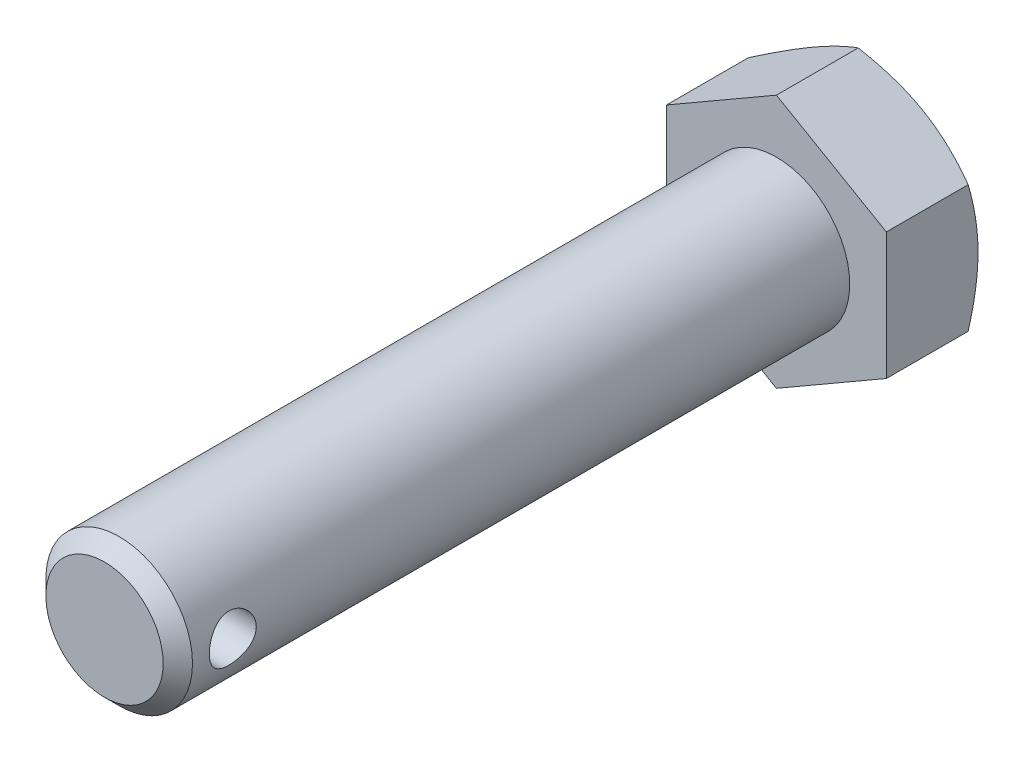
ISO-10303-21;
HEADER;
FILE_DESCRIPTION(('STEP AP214'),'2;1');
FILE_NAME('part.step','',(''),(''),'','','');
FILE_SCHEMA(('AUTOMOTIVE_DESIGN { 1 0 10303 214 1 1 1 1 }'));
ENDSEC;
DATA;
#1=APPLICATION_CONTEXT('core data for automotive mechanical design processes');
#2=APPLICATION_PROTOCOL_DEFINITION('international standard','automotive_design',2000,#1);
#3=PRODUCT_CONTEXT('',#1,'mechanical');
#4=PRODUCT('Part','Part','',(#3));
#5=PRODUCT_RELATED_PRODUCT_CATEGORY('part','',(#4));
#6=PRODUCT_DEFINITION_FORMATION('','',#4);
#7=PRODUCT_DEFINITION_CONTEXT('part definition',#1,'design');
#8=PRODUCT_DEFINITION('design','',#6,#7);
#9=PRODUCT_DEFINITION_SHAPE('','',#8);
#10=(LENGTH_UNIT() NAMED_UNIT(*) SI_UNIT(.MILLI.,.METRE.));
#11=(NAMED_UNIT(*) PLANE_ANGLE_UNIT() SI_UNIT($,.RADIAN.));
#12=(NAMED_UNIT(*) SI_UNIT($,.STERADIAN.) SOLID_ANGLE_UNIT());
#13=UNCERTAINTY_MEASURE_WITH_UNIT(LENGTH_MEASURE(1.E-05),#10,'distance_accuracy_value','');
#14=(GEOMETRIC_REPRESENTATION_CONTEXT(3) GLOBAL_UNCERTAINTY_ASSIGNED_CONTEXT((#13)) GLOBAL_UNIT_ASSIGNED_CONTEXT((#10,
#11,#12)) REPRESENTATION_CONTEXT('',''));
#15=CARTESIAN_POINT('',(0.,0.,0.));
#16=DIRECTION('',(0.,0.,1.));
#17=DIRECTION('',(1.,0.,0.));
#18=AXIS2_PLACEMENT_3D('',#15,#16,#17);
#19=CARTESIAN_POINT('',(-8.32667268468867E-13,-1.11022302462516E-13,55.));
#20=DIRECTION('',(0.,0.,1.));
#21=DIRECTION('',(1.00000000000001,0.,0.));
#22=AXIS2_PLACEMENT_3D('',#19,#20,#21);
#23=PLANE('',#22);
#24=CARTESIAN_POINT('',(-8.32667268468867E-13,-1.11022302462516E-13,55.));
#25=DIRECTION('',(0.,0.,1.));
#26=DIRECTION('',(1.00000000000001,0.,0.));
#27=AXIS2_PLACEMENT_3D('',#24,#25,#26);
#28=CIRCLE('',#27,4.80000000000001);
#29=CARTESIAN_POINT('',(4.79999999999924,-1.11288755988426E-13,55.));
#30=VERTEX_POINT('',#29);
#31=EDGE_CURVE('E209',#30,#30,#28,.T.);
#32=ORIENTED_EDGE('',*,*,#31,.T.);
#33=EDGE_LOOP('',(#32));
#34=FACE_BOUND('',#33,.T.);
#35=ADVANCED_FACE('F28',(#34),#23,.T.);
#36=CARTESIAN_POINT('',(0.,0.,0.));
#37=DIRECTION('',(0.,0.,1.));
#38=DIRECTION('',(1.00000000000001,0.,0.));
#39=AXIS2_PLACEMENT_3D('',#36,#37,#38);
#40=CYLINDRICAL_SURFACE('',#39,6.);
#41=CARTESIAN_POINT('',(6.00000000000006,0.,48.5782929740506));
#42=CARTESIAN_POINT('',(5.99999975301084,0.105083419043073,48.5782932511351));
#43=CARTESIAN_POINT('',(5.99721352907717,0.210170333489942,48.58694055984));
#44=CARTESIAN_POINT('',(5.98637223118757,0.417262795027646,48.6212051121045));
#45=CARTESIAN_POINT('',(5.97831620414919,0.519267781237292,48.646825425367));
#46=CARTESIAN_POINT('',(5.95781364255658,0.717180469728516,48.7140775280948));
#47=CARTESIAN_POINT('',(5.94537410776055,0.813097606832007,48.7556838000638));
#48=CARTESIAN_POINT('',(5.91738350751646,0.996593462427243,48.8536157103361));
#49=CARTESIAN_POINT('',(5.90183190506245,1.08417073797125,48.9099438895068));
#50=CARTESIAN_POINT('',(5.86870146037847,1.25132721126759,49.0376324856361));
#51=CARTESIAN_POINT('',(5.8510768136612,1.33059972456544,49.1093824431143));
#52=CARTESIAN_POINT('',(5.81604704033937,1.47621715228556,49.2650489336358));
#53=CARTESIAN_POINT('',(5.79864195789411,1.54255950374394,49.3489678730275));
#54=CARTESIAN_POINT('',(5.76552595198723,1.66212826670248,49.5292839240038));
#55=CARTESIAN_POINT('',(5.7498713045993,1.71496587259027,49.6259501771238));
#56=CARTESIAN_POINT('',(5.7227203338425,1.80350554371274,49.8273790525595));
#57=CARTESIAN_POINT('',(5.71122285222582,1.83921238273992,49.9321394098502));
#58=CARTESIAN_POINT('',(5.69416828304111,1.8913443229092,50.1433118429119));
#59=CARTESIAN_POINT('',(5.68843575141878,1.90834048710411,50.2495683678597));
#60=CARTESIAN_POINT('',(5.68303994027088,1.92435315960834,50.4635675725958));
#61=CARTESIAN_POINT('',(5.68337495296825,1.92337472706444,50.5713098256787));
#62=CARTESIAN_POINT('',(5.68992192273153,1.90391142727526,50.7804454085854));
#63=CARTESIAN_POINT('',(5.69588783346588,1.8861594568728,50.8819159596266));
#64=CARTESIAN_POINT('',(5.71262361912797,1.83484396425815,51.0803548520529));
#65=CARTESIAN_POINT('',(5.72339402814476,1.80127868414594,51.1773226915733));
#66=CARTESIAN_POINT('',(5.74870891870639,1.71878581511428,51.3657197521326));
#67=CARTESIAN_POINT('',(5.76330817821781,1.66963288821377,51.4570426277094));
#68=CARTESIAN_POINT('',(5.7946114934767,1.55751645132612,51.6303813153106));
#69=CARTESIAN_POINT('',(5.81131611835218,1.4945492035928,51.7123945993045));
#70=CARTESIAN_POINT('',(5.84592806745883,1.35302319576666,51.8689204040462));
#71=CARTESIAN_POINT('',(5.86385465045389,1.27386151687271,51.9428845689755));
#72=CARTESIAN_POINT('',(5.89818619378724,1.10403570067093,52.076624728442));
#73=CARTESIAN_POINT('',(5.91459102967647,1.013370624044,52.1363995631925));
#74=CARTESIAN_POINT('',(5.94421819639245,0.822016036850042,52.2404611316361));
#75=CARTESIAN_POINT('',(5.95741213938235,0.721247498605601,52.2846111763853));
#76=CARTESIAN_POINT('',(5.97892563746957,0.513191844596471,52.3551678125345));
#77=CARTESIAN_POINT('',(5.98724675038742,0.405906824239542,52.3815800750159));
#78=CARTESIAN_POINT('',(5.99782362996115,0.192513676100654,52.4149636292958));
#79=CARTESIAN_POINT('',(6.0003107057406,0.0865329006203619,52.4226767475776));
#80=CARTESIAN_POINT('',(5.99962692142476,-0.125223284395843,52.4205425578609));
#81=CARTESIAN_POINT('',(5.99645693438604,-0.230998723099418,52.4106979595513));
#82=CARTESIAN_POINT('',(5.98496749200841,-0.436440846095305,52.374320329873));
#83=CARTESIAN_POINT('',(5.97678590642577,-0.536195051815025,52.3482338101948));
#84=CARTESIAN_POINT('',(5.95623791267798,-0.729878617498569,52.2806625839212));
#85=CARTESIAN_POINT('',(5.94387098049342,-0.823807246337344,52.2391759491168));
#86=CARTESIAN_POINT('',(5.91583148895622,-1.00580006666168,52.1408203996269));
#87=CARTESIAN_POINT('',(5.90008368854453,-1.09365764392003,52.0835912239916));
#88=CARTESIAN_POINT('',(5.86707788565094,-1.25876844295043,51.9558039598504));
#89=CARTESIAN_POINT('',(5.84981945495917,-1.3360186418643,51.8852420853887));
#90=CARTESIAN_POINT('',(5.81482812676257,-1.48107325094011,51.7293025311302));
#91=CARTESIAN_POINT('',(5.79710550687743,-1.54834858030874,51.6434292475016));
#92=CARTESIAN_POINT('',(5.76393905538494,-1.66758808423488,51.4612281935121));
#93=CARTESIAN_POINT('',(5.74849520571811,-1.71955238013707,51.3649005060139));
#94=CARTESIAN_POINT('',(5.72180002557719,-1.80639816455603,51.1646433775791));
#95=CARTESIAN_POINT('',(5.71053503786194,-1.84133541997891,51.0607400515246));
#96=CARTESIAN_POINT('',(5.69359292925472,-1.89308090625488,50.8480868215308));
#97=CARTESIAN_POINT('',(5.68791354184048,-1.90989649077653,50.7393389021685));
#98=CARTESIAN_POINT('',(5.6830298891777,-1.92437605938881,50.5256371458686));
#99=CARTESIAN_POINT('',(5.68353091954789,-1.92291165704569,50.420748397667));
#100=CARTESIAN_POINT('',(5.69023104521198,-1.90299199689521,50.2127917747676));
#101=CARTESIAN_POINT('',(5.69642984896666,-1.88453760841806,50.1097238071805));
#102=CARTESIAN_POINT('',(5.71361606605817,-1.83175796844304,49.9099796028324));
#103=CARTESIAN_POINT('',(5.72452443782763,-1.7976941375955,49.813226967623));
#104=CARTESIAN_POINT('',(5.74987709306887,-1.71487038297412,49.6267339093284));
#105=CARTESIAN_POINT('',(5.76432212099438,-1.66610736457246,49.5369949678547));
#106=CARTESIAN_POINT('',(5.79585576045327,-1.5529440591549,49.3631105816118));
#107=CARTESIAN_POINT('',(5.81302819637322,-1.4879868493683,49.2793428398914));
#108=CARTESIAN_POINT('',(5.84770927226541,-1.34524481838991,49.1236146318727));
#109=CARTESIAN_POINT('',(5.86521800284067,-1.26745649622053,49.0516573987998));
#110=CARTESIAN_POINT('',(5.89933260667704,-1.09799418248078,48.9190707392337));
#111=CARTESIAN_POINT('',(5.91588559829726,-1.00593014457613,48.8589246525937));
#112=CARTESIAN_POINT('',(5.94554015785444,-0.812469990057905,48.7550374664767));
#113=CARTESIAN_POINT('',(5.95864291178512,-0.711077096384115,48.7112907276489));
#114=CARTESIAN_POINT('',(5.97915760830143,-0.509157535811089,48.6441354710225));
#115=CARTESIAN_POINT('',(5.98690347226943,-0.409066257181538,48.6195184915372));
#116=CARTESIAN_POINT('',(5.99732421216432,-0.205983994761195,48.5865989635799));
#117=CARTESIAN_POINT('',(6.00000024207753,-0.102993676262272,48.5782927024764));
#118=CARTESIAN_POINT('',(6.00000000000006,0.,48.5782929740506));
#119=B_SPLINE_CURVE_WITH_KNOTS('',3,(#41,#42,#43,#44,#45,#46,#47,#48,#49,#50,#51,#52,#53,#54,
#55,#56,#57,#58,#59,#60,#61,#62,#63,#64,#65,#66,#67,#68,#69,#70,#71,#72,#73,#74,#75,#76,#77,#78,
#79,#80,#81,#82,#83,#84,#85,#86,#87,#88,#89,#90,#91,#92,#93,#94,#95,#96,#97,#98,#99,#100,#101,
#102,#103,#104,#105,#106,#107,#108,#109,#110,#111,#112,#113,#114,#115,#116,#117,#118),
.UNSPECIFIED.,.T.,.F.,(4,2,2,2,2,2,2,2,2,2,2,2,2,2,2,2,2,2,2,2,2,2,2,2,2,2,2,2,2,2,2,2,2,2,2,2,
2,2,4),(0.,0.314871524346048,0.629800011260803,0.944227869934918,1.25871003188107,
1.58233831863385,1.9060306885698,2.23819653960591,2.57026977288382,2.89189988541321,
3.21343947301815,3.52154933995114,3.82969346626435,4.14251248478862,4.4554162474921,
4.78332637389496,5.1112632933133,5.44200200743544,5.77263492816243,6.08991944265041,
6.40715499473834,6.71603256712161,7.02494882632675,7.34162591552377,7.65839306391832,
7.98838657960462,8.31837747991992,8.64728020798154,8.9760494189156,9.28920485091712,
9.60234426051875,9.91042089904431,10.218562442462,10.539278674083,10.8600825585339,
11.1920894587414,11.5239820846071,11.8326621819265,12.1412720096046),.UNSPECIFIED.);
#120=CARTESIAN_POINT('',(6.00000000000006,0.,48.5782929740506));
#121=VERTEX_POINT('',#120);
#122=EDGE_CURVE('E31',#121,#121,#119,.T.);
#123=ORIENTED_EDGE('',*,*,#122,.F.);
#124=EDGE_LOOP('',(#123));
#125=FACE_BOUND('',#124,.T.);
#126=CARTESIAN_POINT('',(-6.00000000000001,0.,48.5782929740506));
#127=CARTESIAN_POINT('',(-5.99999975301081,-0.105083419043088,48.5782932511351));
#128=CARTESIAN_POINT('',(-5.99721352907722,-0.210170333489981,48.5869405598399));
#129=CARTESIAN_POINT('',(-5.98637223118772,-0.417262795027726,48.6212051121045));
#130=CARTESIAN_POINT('',(-5.97831620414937,-0.519267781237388,48.646825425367));
#131=CARTESIAN_POINT('',(-5.95781364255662,-0.717180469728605,48.7140775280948));
#132=CARTESIAN_POINT('',(-5.94537410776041,-0.813097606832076,48.7556838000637));
#133=CARTESIAN_POINT('',(-5.91738350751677,-0.996593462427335,48.853615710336));
#134=CARTESIAN_POINT('',(-5.90183190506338,-1.08417073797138,48.9099438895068));
#135=CARTESIAN_POINT('',(-5.8687014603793,-1.25132721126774,49.0376324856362));
#136=CARTESIAN_POINT('',(-5.85107681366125,-1.33059972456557,49.1093824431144));
#137=CARTESIAN_POINT('',(-5.81604704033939,-1.47621715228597,49.2650489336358));
#138=CARTESIAN_POINT('',(-5.79864195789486,-1.54255950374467,49.3489678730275));
#139=CARTESIAN_POINT('',(-5.76552595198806,-1.66212826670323,49.5292839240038));
#140=CARTESIAN_POINT('',(-5.74987130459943,-1.71496587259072,49.6259501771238));
#141=CARTESIAN_POINT('',(-5.72272033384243,-1.80350554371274,49.8273790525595));
#142=CARTESIAN_POINT('',(-5.71122285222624,-1.83921238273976,49.9321394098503));
#143=CARTESIAN_POINT('',(-5.69416828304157,-1.89134432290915,50.143311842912));
#144=CARTESIAN_POINT('',(-5.68843575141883,-1.90834048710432,50.2495683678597));
#145=CARTESIAN_POINT('',(-5.68303994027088,-1.92435315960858,50.4635675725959));
#146=CARTESIAN_POINT('',(-5.6833749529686,-1.92337472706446,50.5713098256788));
#147=CARTESIAN_POINT('',(-5.68992192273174,-1.90391142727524,50.7804454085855));
#148=CARTESIAN_POINT('',(-5.69588783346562,-1.88615945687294,50.8819159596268));
#149=CARTESIAN_POINT('',(-5.71262361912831,-1.83484396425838,51.0803548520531));
#150=CARTESIAN_POINT('',(-5.72339402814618,-1.80127868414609,51.1773226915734));
#151=CARTESIAN_POINT('',(-5.74870891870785,-1.71878581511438,51.3657197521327));
#152=CARTESIAN_POINT('',(-5.76330817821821,-1.66963288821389,51.4570426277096));
#153=CARTESIAN_POINT('',(-5.79461149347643,-1.55751645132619,51.6303813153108));
#154=CARTESIAN_POINT('',(-5.8113161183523,-1.4945492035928,51.7123945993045));
#155=CARTESIAN_POINT('',(-5.84592806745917,-1.35302319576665,51.8689204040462));
#156=CARTESIAN_POINT('',(-5.86385465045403,-1.27386151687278,51.9428845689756));
#157=CARTESIAN_POINT('',(-5.89818619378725,-1.10403570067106,52.0766247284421));
#158=CARTESIAN_POINT('',(-5.91459102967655,-1.01337062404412,52.1363995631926));
#159=CARTESIAN_POINT('',(-5.94421819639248,-0.822016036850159,52.2404611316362));
#160=CARTESIAN_POINT('',(-5.95741213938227,-0.721247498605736,52.2846111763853));
#161=CARTESIAN_POINT('',(-5.97892563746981,-0.513191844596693,52.3551678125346));
#162=CARTESIAN_POINT('',(-5.9872467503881,-0.405906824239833,52.381580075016));
#163=CARTESIAN_POINT('',(-5.99782362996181,-0.192513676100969,52.4149636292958));
#164=CARTESIAN_POINT('',(-6.00031070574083,-0.0865329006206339,52.4226767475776));
#165=CARTESIAN_POINT('',(-5.99962692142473,0.125223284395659,52.4205425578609));
#166=CARTESIAN_POINT('',(-5.99645693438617,0.230998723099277,52.4106979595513));
#167=CARTESIAN_POINT('',(-5.98496749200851,0.436440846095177,52.374320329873));
#168=CARTESIAN_POINT('',(-5.9767859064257,0.536195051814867,52.3482338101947));
#169=CARTESIAN_POINT('',(-5.95623791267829,0.729878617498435,52.2806625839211));
#170=CARTESIAN_POINT('',(-5.94387098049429,0.823807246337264,52.2391759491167));
#171=CARTESIAN_POINT('',(-5.91583148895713,1.0058000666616,52.1408203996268));
#172=CARTESIAN_POINT('',(-5.90008368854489,1.09365764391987,52.0835912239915));
#173=CARTESIAN_POINT('',(-5.86707788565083,1.25876844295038,51.9558039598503));
#174=CARTESIAN_POINT('',(-5.84981945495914,1.33601864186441,51.8852420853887));
#175=CARTESIAN_POINT('',(-5.81482812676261,1.48107325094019,51.7293025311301));
#176=CARTESIAN_POINT('',(-5.79710550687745,1.54834858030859,51.6434292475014));
#177=CARTESIAN_POINT('',(-5.76393905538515,1.66758808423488,51.4612281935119));
#178=CARTESIAN_POINT('',(-5.74849520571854,1.71955238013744,51.3649005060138));
#179=CARTESIAN_POINT('',(-5.72180002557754,1.80639816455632,51.1646433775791));
#180=CARTESIAN_POINT('',(-5.710535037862,1.84133541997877,51.0607400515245));
#181=CARTESIAN_POINT('',(-5.69359292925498,1.89308090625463,50.8480868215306));
#182=CARTESIAN_POINT('',(-5.68791354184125,1.90989649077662,50.7393389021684));
#183=CARTESIAN_POINT('',(-5.68302988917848,1.92437605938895,50.5256371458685));
#184=CARTESIAN_POINT('',(-5.68353091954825,1.92291165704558,50.4207483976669));
#185=CARTESIAN_POINT('',(-5.69023104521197,1.90299199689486,50.2127917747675));
#186=CARTESIAN_POINT('',(-5.69642984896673,1.88453760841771,50.1097238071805));
#187=CARTESIAN_POINT('',(-5.71361606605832,1.83175796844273,49.9099796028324));
#188=CARTESIAN_POINT('',(-5.72452443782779,1.79769413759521,49.813226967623));
#189=CARTESIAN_POINT('',(-5.74987709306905,1.71487038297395,49.6267339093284));
#190=CARTESIAN_POINT('',(-5.76432212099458,1.66610736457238,49.5369949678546));
#191=CARTESIAN_POINT('',(-5.79585576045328,1.5529440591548,49.3631105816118));
#192=CARTESIAN_POINT('',(-5.81302819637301,1.48798684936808,49.2793428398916));
#193=CARTESIAN_POINT('',(-5.84770927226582,1.34524481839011,49.1236146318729));
#194=CARTESIAN_POINT('',(-5.86521800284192,1.26745649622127,49.0516573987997));
#195=CARTESIAN_POINT('',(-5.89933260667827,1.09799418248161,48.9190707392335));
#196=CARTESIAN_POINT('',(-5.91588559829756,1.00593014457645,48.8589246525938));
#197=CARTESIAN_POINT('',(-5.94554015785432,0.812469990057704,48.7550374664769));
#198=CARTESIAN_POINT('',(-5.95864291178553,0.711077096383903,48.7112907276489));
#199=CARTESIAN_POINT('',(-5.979157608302,0.509157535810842,48.6441354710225));
#200=CARTESIAN_POINT('',(-5.9869034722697,0.409066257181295,48.6195184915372));
#201=CARTESIAN_POINT('',(-5.99732421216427,0.205983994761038,48.5865989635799));
#202=CARTESIAN_POINT('',(-6.00000024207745,0.102993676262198,48.5782927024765));
#203=CARTESIAN_POINT('',(-6.00000000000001,0.,48.5782929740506));
#204=B_SPLINE_CURVE_WITH_KNOTS('',3,(#126,#127,#128,#129,#130,#131,#132,#133,#134,#135,#136,
#137,#138,#139,#140,#141,#142,#143,#144,#145,#146,#147,#148,#149,#150,#151,#152,#153,#154,#155,
#156,#157,#158,#159,#160,#161,#162,#163,#164,#165,#166,#167,#168,#169,#170,#171,#172,#173,#174,
#175,#176,#177,#178,#179,#180,#181,#182,#183,#184,#185,#186,#187,#188,#189,#190,#191,#192,#193,
#194,#195,#196,#197,#198,#199,#200,#201,#202,#203),.UNSPECIFIED.,.T.,.F.,(4,2,2,2,2,2,2,2,2,2,2,
2,2,2,2,2,2,2,2,2,2,2,2,2,2,2,2,2,2,2,2,2,2,2,2,2,2,2,4),(0.,0.3148715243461,0.629800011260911,
0.944227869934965,1.2587100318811,1.58233831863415,1.90603068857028,2.23819653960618,
2.57026977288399,2.89189988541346,3.21343947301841,3.52154933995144,3.82969346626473,
4.14251248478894,4.45541624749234,4.78332637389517,5.11126329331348,5.44200200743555,
5.77263492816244,6.08991944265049,6.40715499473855,6.7160325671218,7.02494882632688,
7.34162591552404,7.65839306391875,7.98838657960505,8.31837747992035,8.6472802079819,
8.9760494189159,9.28920485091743,9.60234426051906,9.91042089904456,10.2185624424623,
10.539278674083,10.8600825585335,11.1920894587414,11.5239820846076,11.8326621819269,
12.1412720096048),.UNSPECIFIED.);
#205=CARTESIAN_POINT('',(-6.00000000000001,0.,48.5782929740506));
#206=VERTEX_POINT('',#205);
#207=EDGE_CURVE('E220',#206,#206,#204,.T.);
#208=ORIENTED_EDGE('',*,*,#207,.F.);
#209=EDGE_LOOP('',(#208));
#210=FACE_BOUND('',#209,.T.);
#211=CARTESIAN_POINT('',(-8.32667268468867E-13,-1.11022302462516E-13,53.8));
#212=DIRECTION('',(0.,0.,1.));
#213=DIRECTION('',(1.00000000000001,0.,0.));
#214=AXIS2_PLACEMENT_3D('',#211,#212,#213);
#215=CIRCLE('',#214,6.);
#216=CARTESIAN_POINT('',(5.99999999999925,-1.11355369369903E-13,53.8));
#217=VERTEX_POINT('',#216);
#218=EDGE_CURVE('E211',#217,#217,#215,.F.);
#219=ORIENTED_EDGE('',*,*,#218,.T.);
#220=EDGE_LOOP('',(#219));
#221=FACE_BOUND('',#220,.T.);
#222=CARTESIAN_POINT('',(0.,0.,0.));
#223=DIRECTION('',(0.,0.,1.));
#224=DIRECTION('',(1.00000000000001,0.,0.));
#225=AXIS2_PLACEMENT_3D('',#222,#223,#224);
#226=CIRCLE('',#225,6.);
#227=CARTESIAN_POINT('',(6.00000000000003,0.,0.));
#228=VERTEX_POINT('',#227);
#229=EDGE_CURVE('E212',#228,#228,#226,.F.);
#230=ORIENTED_EDGE('',*,*,#229,.F.);
#231=EDGE_LOOP('',(#230));
#232=FACE_BOUND('',#231,.T.);
#233=ADVANCED_FACE('F200',(#125,#210,#221,#232),#40,.T.);
#234=CARTESIAN_POINT('',(-8.32667268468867E-13,-1.11022302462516E-13,55.));
#235=DIRECTION('',(0.,0.,-1.));
#236=DIRECTION('',(-1.00000000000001,0.,0.));
#237=AXIS2_PLACEMENT_3D('',#234,#235,#236);
#238=CONICAL_SURFACE('',#237,4.80000000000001,0.785398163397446);
#239=ORIENTED_EDGE('',*,*,#218,.F.);
#240=EDGE_LOOP('',(#239));
#241=FACE_BOUND('',#240,.T.);
#242=ORIENTED_EDGE('',*,*,#31,.F.);
#243=EDGE_LOOP('',(#242));
#244=FACE_BOUND('',#243,.T.);
#245=ADVANCED_FACE('F205',(#241,#244),#238,.T.);
#246=CARTESIAN_POINT('',(0.,10.3923048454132,-7.50000000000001));
#247=DIRECTION('',(0.500000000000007,0.866025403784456,0.));
#248=DIRECTION('',(-0.866025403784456,0.500000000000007,0.));
#249=AXIS2_PLACEMENT_3D('',#246,#247,#248);
#250=PLANE('',#249);
#251=CARTESIAN_POINT('',(-0.000200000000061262,10.3924203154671,-6.69608575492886));
#252=CARTESIAN_POINT('',(0.197607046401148,10.2782163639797,-6.76201799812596));
#253=CARTESIAN_POINT('',(0.396185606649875,10.1635669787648,-6.82495859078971));
#254=CARTESIAN_POINT('',(0.79495536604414,9.93333715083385,-6.94403100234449));
#255=CARTESIAN_POINT('',(0.995147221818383,9.81775632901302,-7.00015988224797));
#256=CARTESIAN_POINT('',(1.39751505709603,9.58544915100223,-7.10484803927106));
#257=CARTESIAN_POINT('',(1.59969459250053,9.46872074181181,-7.15338922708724));
#258=CARTESIAN_POINT('',(2.00542875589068,9.23447001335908,-7.24185148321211));
#259=CARTESIAN_POINT('',(2.20898309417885,9.11694786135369,-7.28177431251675));
#260=CARTESIAN_POINT('',(2.61230590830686,8.88408932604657,-7.35131532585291));
#261=CARTESIAN_POINT('',(2.81204459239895,8.76877014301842,-7.38116249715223));
#262=CARTESIAN_POINT('',(3.21241567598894,8.53761579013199,-7.43120669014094));
#263=CARTESIAN_POINT('',(3.41304799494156,8.42178066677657,-7.45140456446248));
#264=CARTESIAN_POINT('',(3.81466063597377,8.18990950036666,-7.48164565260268));
#265=CARTESIAN_POINT('',(4.01564030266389,8.07387383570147,-7.49170039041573));
#266=CARTESIAN_POINT('',(4.41778459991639,7.84169571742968,-7.50143766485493));
#267=CARTESIAN_POINT('',(4.61894922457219,7.72555326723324,-7.50112052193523));
#268=CARTESIAN_POINT('',(4.99503261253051,7.50842142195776,-7.49083604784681));
#269=CARTESIAN_POINT('',(5.16997789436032,7.40741671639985,-7.48212325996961));
#270=CARTESIAN_POINT('',(5.51945867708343,7.20564389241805,-7.45702265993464));
#271=CARTESIAN_POINT('',(5.69399414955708,7.10487579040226,-7.44063433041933));
#272=CARTESIAN_POINT('',(6.2169248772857,6.80296159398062,-7.38034344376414));
#273=CARTESIAN_POINT('',(6.56439451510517,6.60234990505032,-7.32532251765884));
#274=CARTESIAN_POINT('',(7.26301962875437,6.19899850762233,-7.18776952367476));
#275=CARTESIAN_POINT('',(7.61408594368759,5.99631027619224,-7.10465438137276));
#276=CARTESIAN_POINT('',(8.31098330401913,5.59395639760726,-6.91601746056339));
#277=CARTESIAN_POINT('',(8.65682327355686,5.39428559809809,-6.81053998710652));
#278=CARTESIAN_POINT('',(9.00020000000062,5.19603695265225,-6.69608575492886));
#279=B_SPLINE_CURVE_WITH_KNOTS('',3,(#251,#252,#253,#254,#255,#256,#257,#258,#259,#260,#261,
#262,#263,#264,#265,#266,#267,#268,#269,#270,#271,#272,#273,#274,#275,#276,#277,#278),
.UNSPECIFIED.,.F.,.F.,(4,2,2,2,2,2,2,2,2,2,2,2,2,4),(0.,0.713219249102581,1.42674513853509,
2.14194697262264,2.85700253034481,3.55449749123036,4.25193080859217,4.94857085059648,
5.64518936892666,6.25162976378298,6.85811104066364,8.07193747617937,9.31268391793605,
10.5509947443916),.UNSPECIFIED.);
#280=CARTESIAN_POINT('',(0.,10.3923048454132,-6.6961524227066));
#281=VERTEX_POINT('',#280);
#282=CARTESIAN_POINT('',(4.50000000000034,7.79422863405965,-7.50000000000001));
#283=VERTEX_POINT('',#282);
#284=EDGE_CURVE('E245',#281,#283,#279,.T.);
#285=ORIENTED_EDGE('',*,*,#284,.F.);
#286=DIRECTION('',(0.,0.,1.));
#287=VECTOR('',#286,1.);
#288=CARTESIAN_POINT('',(0.,10.3923048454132,-7.50000000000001));
#289=LINE('',#288,#287);
#290=CARTESIAN_POINT('',(0.,10.3923048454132,0.));
#291=VERTEX_POINT('',#290);
#292=EDGE_CURVE('E242',#281,#291,#289,.T.);
#293=ORIENTED_EDGE('',*,*,#292,.T.);
#294=DIRECTION('',(-0.866025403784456,0.500000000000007,0.));
#295=VECTOR('',#294,1.);
#296=CARTESIAN_POINT('',(0.,10.3923048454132,0.));
#297=LINE('',#296,#295);
#298=CARTESIAN_POINT('',(9.00000000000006,5.19615242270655,0.));
#299=VERTEX_POINT('',#298);
#300=EDGE_CURVE('E250',#299,#291,#297,.T.);
#301=ORIENTED_EDGE('',*,*,#300,.F.);
#302=DIRECTION('',(0.,0.,1.));
#303=VECTOR('',#302,1.);
#304=CARTESIAN_POINT('',(9.00000000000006,5.19615242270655,-7.50000000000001));
#305=LINE('',#304,#303);
#306=CARTESIAN_POINT('',(9.00000000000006,5.19615242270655,-6.6961524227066));
#307=VERTEX_POINT('',#306);
#308=EDGE_CURVE('E217',#307,#299,#305,.T.);
#309=ORIENTED_EDGE('',*,*,#308,.F.);
#310=EDGE_CURVE('E175',#283,#307,#279,.T.);
#311=ORIENTED_EDGE('',*,*,#310,.F.);
#312=EDGE_LOOP('',(#285,#293,#301,#309,#311));
#313=FACE_BOUND('',#312,.T.);
#314=ADVANCED_FACE('F185',(#313),#250,.T.);
#315=CARTESIAN_POINT('',(9.00000000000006,-5.19615242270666,-7.50000000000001));
#316=DIRECTION('',(1.00000000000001,0.,0.));
#317=DIRECTION('',(0.,0.,-1.));
#318=AXIS2_PLACEMENT_3D('',#315,#316,#317);
#319=PLANE('',#318);
#320=CARTESIAN_POINT('',(8.99999999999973,-14.1938054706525,-2.99281770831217));
#321=CARTESIAN_POINT('',(8.99999999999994,-13.7986249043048,-3.18545400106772));
#322=CARTESIAN_POINT('',(9.00000000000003,-13.4025620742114,-3.37631016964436));
#323=CARTESIAN_POINT('',(9.00000000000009,-12.6082034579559,-3.75346543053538));
#324=CARTESIAN_POINT('',(9.00000000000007,-12.2099073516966,-3.93976384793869));
#325=CARTESIAN_POINT('',(9.00000000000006,-11.4086732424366,-4.30769386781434));
#326=CARTESIAN_POINT('',(9.00000000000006,-11.0057218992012,-4.48929651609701));
#327=CARTESIAN_POINT('',(9.00000000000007,-10.1966954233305,-4.84537774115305));
#328=CARTESIAN_POINT('',(9.00000000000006,-9.79062043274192,-5.01985663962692));
#329=CARTESIAN_POINT('',(9.00000000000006,-8.96081603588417,-5.36560228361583));
#330=CARTESIAN_POINT('',(9.00000000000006,-8.53695616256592,-5.536557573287));
#331=CARTESIAN_POINT('',(9.00000000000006,-7.6843668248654,-5.86609252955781));
#332=CARTESIAN_POINT('',(9.00000000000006,-7.25563683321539,-6.02467084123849));
#333=CARTESIAN_POINT('',(9.00000000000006,-6.39334839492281,-6.32546141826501));
#334=CARTESIAN_POINT('',(9.00000000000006,-5.95980093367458,-6.46770484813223));
#335=CARTESIAN_POINT('',(9.00000000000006,-5.08650675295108,-6.73142002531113));
#336=CARTESIAN_POINT('',(9.00000000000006,-4.64676195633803,-6.85289806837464));
#337=CARTESIAN_POINT('',(9.00000000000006,-3.76318857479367,-7.06875933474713));
#338=CARTESIAN_POINT('',(9.00000000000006,-3.31939822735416,-7.16329494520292));
#339=CARTESIAN_POINT('',(9.00000000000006,-2.6494895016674,-7.28091249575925));
#340=CARTESIAN_POINT('',(9.00000000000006,-2.42546830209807,-7.31608884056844));
#341=CARTESIAN_POINT('',(9.00000000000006,-1.976233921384,-7.37769613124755));
#342=CARTESIAN_POINT('',(9.00000000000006,-1.75102085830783,-7.40412792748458));
#343=CARTESIAN_POINT('',(9.00000000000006,-1.30274989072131,-7.44737513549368));
#344=CARTESIAN_POINT('',(9.00000000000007,-1.0797041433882,-7.46431601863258));
#345=CARTESIAN_POINT('',(9.00000000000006,-0.633095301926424,-7.48874105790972));
#346=CARTESIAN_POINT('',(9.00000000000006,-0.409532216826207,-7.49622537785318));
#347=CARTESIAN_POINT('',(9.00000000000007,0.037712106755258,-7.50155767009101));
#348=CARTESIAN_POINT('',(9.00000000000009,0.261393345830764,-7.49940559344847));
#349=CARTESIAN_POINT('',(9.00000000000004,0.708460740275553,-7.48552018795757));
#350=CARTESIAN_POINT('',(8.99999999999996,0.931846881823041,-7.47378642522));
#351=CARTESIAN_POINT('',(8.99999999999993,1.46162752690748,-7.4348503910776));
#352=CARTESIAN_POINT('',(9.00000000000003,1.7677239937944,-7.40349650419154));
#353=CARTESIAN_POINT('',(9.0000000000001,2.37778404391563,-7.32445593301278));
#354=CARTESIAN_POINT('',(9.00000000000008,2.68174735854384,-7.27676722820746));
#355=CARTESIAN_POINT('',(9.00000000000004,3.5900033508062,-7.11171638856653));
#356=CARTESIAN_POINT('',(9.00000000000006,4.19036603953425,-6.97239428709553));
#357=CARTESIAN_POINT('',(9.00000000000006,5.08858153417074,-6.72898039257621));
#358=CARTESIAN_POINT('',(9.00000000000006,5.39104017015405,-6.64089135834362));
#359=CARTESIAN_POINT('',(9.00000000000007,5.99302412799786,-6.45511431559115));
#360=CARTESIAN_POINT('',(9.00000000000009,6.29254942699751,-6.35742623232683));
#361=CARTESIAN_POINT('',(9.00000000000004,6.88875586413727,-6.15405553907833));
#362=CARTESIAN_POINT('',(8.99999999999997,7.18543776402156,-6.0483751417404));
#363=CARTESIAN_POINT('',(9.00000000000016,7.7763104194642,-5.83030807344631));
#364=CARTESIAN_POINT('',(9.00000000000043,8.07050123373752,-5.71792156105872));
#365=CARTESIAN_POINT('',(9.00000000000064,8.86768097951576,-5.40462740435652));
#366=CARTESIAN_POINT('',(9.00000000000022,9.36851420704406,-5.19823951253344));
#367=CARTESIAN_POINT('',(8.99999999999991,10.3649647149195,-4.77318997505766));
#368=CARTESIAN_POINT('',(9.00000000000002,10.8605813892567,-4.5545269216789));
#369=CARTESIAN_POINT('',(9.00000000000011,11.847807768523,-4.10785524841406));
#370=CARTESIAN_POINT('',(9.00000000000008,12.3394158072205,-3.87984295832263));
#371=CARTESIAN_POINT('',(9.00000000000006,13.3192435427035,-3.41672758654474));
#372=CARTESIAN_POINT('',(9.00000000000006,13.8074633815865,-3.18162480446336));
#373=CARTESIAN_POINT('',(9.00000000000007,14.7819931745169,-2.70549247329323));
#374=CARTESIAN_POINT('',(9.00000000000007,15.2682986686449,-2.46445381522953));
#375=CARTESIAN_POINT('',(9.00000000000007,16.2387067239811,-1.97797920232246));
#376=CARTESIAN_POINT('',(9.00000000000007,16.7228092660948,-1.73254320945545));
#377=CARTESIAN_POINT('',(9.00000000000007,17.6890969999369,-1.23819989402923));
#378=CARTESIAN_POINT('',(9.00000000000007,18.1712826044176,-0.989293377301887));
#379=CARTESIAN_POINT('',(9.00000000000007,19.1341609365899,-0.488607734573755));
#380=CARTESIAN_POINT('',(9.00000000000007,19.6148536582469,-0.236828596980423));
#381=CARTESIAN_POINT('',(9.00000000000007,20.9522159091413,0.467839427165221));
#382=CARTESIAN_POINT('',(9.00000000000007,21.807529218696,0.923301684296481));
#383=CARTESIAN_POINT('',(9.00000000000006,23.5152984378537,1.83966951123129));
#384=CARTESIAN_POINT('',(9.00000000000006,24.3677541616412,2.30057542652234));
#385=CARTESIAN_POINT('',(9.00000000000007,26.0675482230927,3.224858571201));
#386=CARTESIAN_POINT('',(9.00000000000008,26.9148940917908,3.68822195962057));
#387=CARTESIAN_POINT('',(9.00000000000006,28.1846057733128,4.38556367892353));
#388=CARTESIAN_POINT('',(9.00000000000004,28.607608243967,4.61838432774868));
#389=CARTESIAN_POINT('',(9.00000000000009,29.4532343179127,5.08471147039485));
#390=CARTESIAN_POINT('',(9.00000000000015,29.8758579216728,5.31821796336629));
#391=CARTESIAN_POINT('',(9.00000000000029,30.2983153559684,5.55202477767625));
#392=B_SPLINE_CURVE_WITH_KNOTS('',3,(#320,#321,#322,#323,#324,#325,#326,#327,#328,#329,#330,
#331,#332,#333,#334,#335,#336,#337,#338,#339,#340,#341,#342,#343,#344,#345,#346,#347,#348,#349,
#350,#351,#352,#353,#354,#355,#356,#357,#358,#359,#360,#361,#362,#363,#364,#365,#366,#367,#368,
#369,#370,#371,#372,#373,#374,#375,#376,#377,#378,#379,#380,#381,#382,#383,#384,#385,#386,#387,
#388,#389,#390,#391),.UNSPECIFIED.,.F.,.F.,(4,2,2,2,2,2,2,2,2,2,2,2,2,2,2,2,2,2,2,2,2,2,2,2,2,2,
2,2,2,2,2,2,2,2,2,4),(0.,1.31891143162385,2.63801699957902,3.96391175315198,5.28974656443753,
6.66070766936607,8.03181864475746,9.40026868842,10.7683030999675,12.1284389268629,
12.8085936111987,13.4886821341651,14.1595537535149,14.8304137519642,15.5012771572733,
16.1721709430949,17.094749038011,18.0174412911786,19.8637129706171,20.8087031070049,
21.7537006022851,22.6984374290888,23.6431519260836,25.267980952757,26.8929966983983,
28.5186565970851,30.1442479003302,31.7725119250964,33.4007900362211,35.0286961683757,
36.6566088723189,39.5636489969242,42.4708746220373,45.3681585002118,46.8166845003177,
48.2652087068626),.UNSPECIFIED.);
#393=CARTESIAN_POINT('',(8.99999999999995,-1.11022302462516E-13,-7.50000000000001));
#394=VERTEX_POINT('',#393);
#395=EDGE_CURVE('E173',#307,#394,#392,.F.);
#396=ORIENTED_EDGE('',*,*,#395,.F.);
#397=ORIENTED_EDGE('',*,*,#308,.T.);
#398=DIRECTION('',(0.,1.00000000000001,0.));
#399=VECTOR('',#398,1.);
#400=CARTESIAN_POINT('',(9.00000000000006,-5.19615242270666,0.));
#401=LINE('',#400,#399);
#402=CARTESIAN_POINT('',(9.00000000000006,-5.19615242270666,0.));
#403=VERTEX_POINT('',#402);
#404=EDGE_CURVE('E278',#403,#299,#401,.T.);
#405=ORIENTED_EDGE('',*,*,#404,.F.);
#406=DIRECTION('',(0.,0.,1.));
#407=VECTOR('',#406,1.);
#408=CARTESIAN_POINT('',(9.00000000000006,-5.19615242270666,-7.50000000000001));
#409=LINE('',#408,#407);
#410=CARTESIAN_POINT('',(9.00000000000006,-5.19615242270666,-6.6961524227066));
#411=VERTEX_POINT('',#410);
#412=EDGE_CURVE('E259',#411,#403,#409,.T.);
#413=ORIENTED_EDGE('',*,*,#412,.F.);
#414=EDGE_CURVE('E168',#394,#411,#392,.F.);
#415=ORIENTED_EDGE('',*,*,#414,.F.);
#416=EDGE_LOOP('',(#396,#397,#405,#413,#415));
#417=FACE_BOUND('',#416,.T.);
#418=ADVANCED_FACE('F181',(#417),#319,.T.);
#419=CARTESIAN_POINT('',(-1.66533453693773E-13,-10.3923048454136,-7.50000000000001));
#420=DIRECTION('',(0.500000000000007,-0.866025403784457,0.));
#421=DIRECTION('',(0.866025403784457,0.500000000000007,0.));
#422=AXIS2_PLACEMENT_3D('',#419,#420,#421);
#423=PLANE('',#422);
#424=CARTESIAN_POINT('',(9.00019999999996,-5.19603695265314,-6.69608575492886));
#425=CARTESIAN_POINT('',(8.80239295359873,-5.31024090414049,-6.76201799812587));
#426=CARTESIAN_POINT('',(8.60381439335,-5.42489028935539,-6.82495859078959));
#427=CARTESIAN_POINT('',(8.20504463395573,-5.65512011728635,-6.94403100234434));
#428=CARTESIAN_POINT('',(8.00485277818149,-5.77070093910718,-7.00015988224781));
#429=CARTESIAN_POINT('',(7.60248494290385,-6.00300811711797,-7.10484803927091));
#430=CARTESIAN_POINT('',(7.40030540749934,-6.11973652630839,-7.15338922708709));
#431=CARTESIAN_POINT('',(6.99457124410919,-6.35398725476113,-7.24185148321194));
#432=CARTESIAN_POINT('',(6.79101690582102,-6.47150940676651,-7.28177431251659));
#433=CARTESIAN_POINT('',(6.38769409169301,-6.70436794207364,-7.35131532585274));
#434=CARTESIAN_POINT('',(6.18795540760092,-6.81968712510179,-7.38116249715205));
#435=CARTESIAN_POINT('',(5.78758432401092,-7.05084147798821,-7.43120669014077));
#436=CARTESIAN_POINT('',(5.58695200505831,-7.16667660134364,-7.45140456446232));
#437=CARTESIAN_POINT('',(5.1853393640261,-7.39854776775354,-7.48164565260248));
#438=CARTESIAN_POINT('',(4.98435969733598,-7.51458343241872,-7.49170039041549));
#439=CARTESIAN_POINT('',(4.5822154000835,-7.74676155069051,-7.50143766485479));
#440=CARTESIAN_POINT('',(4.3810507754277,-7.86290400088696,-7.50112052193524));
#441=CARTESIAN_POINT('',(4.00496738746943,-8.08003584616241,-7.4908360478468));
#442=CARTESIAN_POINT('',(3.83002210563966,-8.18104055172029,-7.48212325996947));
#443=CARTESIAN_POINT('',(3.48054132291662,-8.38281337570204,-7.45702265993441));
#444=CARTESIAN_POINT('',(3.306005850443,-8.48358147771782,-7.44063433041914));
#445=CARTESIAN_POINT('',(2.78307512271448,-8.7854956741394,-7.38034344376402));
#446=CARTESIAN_POINT('',(2.43560548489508,-8.98610736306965,-7.32532251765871));
#447=CARTESIAN_POINT('',(1.73698037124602,-9.38945876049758,-7.18776952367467));
#448=CARTESIAN_POINT('',(1.38591405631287,-9.59214699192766,-7.10465438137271));
#449=CARTESIAN_POINT('',(0.689016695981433,-9.9945008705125,-6.9160174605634));
#450=CARTESIAN_POINT('',(0.343176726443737,-10.1941716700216,-6.81053998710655));
#451=CARTESIAN_POINT('',(-0.000200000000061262,-10.3924203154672,-6.69608575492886));
#452=B_SPLINE_CURVE_WITH_KNOTS('',3,(#424,#425,#426,#427,#428,#429,#430,#431,#432,#433,#434,
#435,#436,#437,#438,#439,#440,#441,#442,#443,#444,#445,#446,#447,#448,#449,#450,#451),
.UNSPECIFIED.,.F.,.F.,(4,2,2,2,2,2,2,2,2,2,2,2,2,4),(0.,0.713219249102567,1.42674513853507,
2.14194697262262,2.8570025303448,3.55449749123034,4.25193080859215,4.94857085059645,
5.64518936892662,6.2516297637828,6.85811104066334,8.07193747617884,9.31268391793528,
10.5509947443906),.UNSPECIFIED.);
#453=CARTESIAN_POINT('',(4.49999999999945,-7.79422863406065,-7.50000000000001));
#454=VERTEX_POINT('',#453);
#455=EDGE_CURVE('E174',#411,#454,#452,.T.);
#456=ORIENTED_EDGE('',*,*,#455,.F.);
#457=ORIENTED_EDGE('',*,*,#412,.T.);
#458=DIRECTION('',(0.866025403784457,0.500000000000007,0.));
#459=VECTOR('',#458,1.);
#460=CARTESIAN_POINT('',(-1.66533453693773E-13,-10.3923048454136,0.));
#461=LINE('',#460,#459);
#462=CARTESIAN_POINT('',(-1.66533453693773E-13,-10.3923048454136,0.));
#463=VERTEX_POINT('',#462);
#464=EDGE_CURVE('E270',#463,#403,#461,.T.);
#465=ORIENTED_EDGE('',*,*,#464,.F.);
#466=DIRECTION('',(0.,0.,1.));
#467=VECTOR('',#466,1.);
#468=CARTESIAN_POINT('',(-1.66533453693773E-13,-10.3923048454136,-7.50000000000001));
#469=LINE('',#468,#467);
#470=CARTESIAN_POINT('',(-1.66533453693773E-13,-10.3923048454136,-6.6961524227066));
#471=VERTEX_POINT('',#470);
#472=EDGE_CURVE('E269',#471,#463,#469,.T.);
#473=ORIENTED_EDGE('',*,*,#472,.F.);
#474=EDGE_CURVE('E162',#454,#471,#452,.T.);
#475=ORIENTED_EDGE('',*,*,#474,.F.);
#476=EDGE_LOOP('',(#456,#457,#465,#473,#475));
#477=FACE_BOUND('',#476,.T.);
#478=ADVANCED_FACE('F184',(#477),#423,.T.);
#479=CARTESIAN_POINT('',(-1.66533453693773E-13,-10.3923048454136,-7.50000000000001));
#480=DIRECTION('',(-0.500000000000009,-0.866025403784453,0.));
#481=DIRECTION('',(0.866025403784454,-0.50000000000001,0.));
#482=AXIS2_PLACEMENT_3D('',#479,#480,#481);
#483=PLANE('',#482);
#484=CARTESIAN_POINT('',(0.000199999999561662,-10.3924203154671,-6.69608575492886));
#485=CARTESIAN_POINT('',(-0.197607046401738,-10.2782163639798,-6.76201799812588));
#486=CARTESIAN_POINT('',(-0.396185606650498,-10.163566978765,-6.82495859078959));
#487=CARTESIAN_POINT('',(-0.79495536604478,-9.93333715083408,-6.94403100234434));
#488=CARTESIAN_POINT('',(-0.995147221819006,-9.81775632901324,-7.00015988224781));
#489=CARTESIAN_POINT('',(-1.39751505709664,-9.58544915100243,-7.1048480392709));
#490=CARTESIAN_POINT('',(-1.59969459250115,-9.46872074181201,-7.15338922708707));
#491=CARTESIAN_POINT('',(-2.0054287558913,-9.23447001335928,-7.24185148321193));
#492=CARTESIAN_POINT('',(-2.20898309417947,-9.11694786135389,-7.28177431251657));
#493=CARTESIAN_POINT('',(-2.61230590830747,-8.88408932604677,-7.35131532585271));
#494=CARTESIAN_POINT('',(-2.81204459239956,-8.76877014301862,-7.38116249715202));
#495=CARTESIAN_POINT('',(-3.21241567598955,-8.5376157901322,-7.43120669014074));
#496=CARTESIAN_POINT('',(-3.41304799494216,-8.42178066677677,-7.45140456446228));
#497=CARTESIAN_POINT('',(-3.81466063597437,-8.18990950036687,-7.48164565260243));
#498=CARTESIAN_POINT('',(-4.01564030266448,-8.07387383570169,-7.49170039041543));
#499=CARTESIAN_POINT('',(-4.41778459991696,-7.8416957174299,-7.50143766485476));
#500=CARTESIAN_POINT('',(-4.61894922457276,-7.72555326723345,-7.50112052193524));
#501=CARTESIAN_POINT('',(-4.99503261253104,-7.508421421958,-7.49083604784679));
#502=CARTESIAN_POINT('',(-5.16997789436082,-7.40741671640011,-7.48212325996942));
#503=CARTESIAN_POINT('',(-5.51945867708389,-7.20564389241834,-7.45702265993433));
#504=CARTESIAN_POINT('',(-5.69399414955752,-7.10487579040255,-7.44063433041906));
#505=CARTESIAN_POINT('',(-6.21692487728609,-6.80296159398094,-7.38034344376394));
#506=CARTESIAN_POINT('',(-6.56439451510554,-6.60234990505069,-7.32532251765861));
#507=CARTESIAN_POINT('',(-7.26301962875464,-6.19899850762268,-7.18776952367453));
#508=CARTESIAN_POINT('',(-7.61408594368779,-5.99631027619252,-7.10465438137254));
#509=CARTESIAN_POINT('',(-8.31098330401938,-5.59395639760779,-6.91601746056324));
#510=CARTESIAN_POINT('',(-8.65682327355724,-5.39428559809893,-6.81053998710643));
#511=CARTESIAN_POINT('',(-9.0002000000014,-5.1960369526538,-6.69608575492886));
#512=B_SPLINE_CURVE_WITH_KNOTS('',3,(#484,#485,#486,#487,#488,#489,#490,#491,#492,#493,#494,
#495,#496,#497,#498,#499,#500,#501,#502,#503,#504,#505,#506,#507,#508,#509,#510,#511),
.UNSPECIFIED.,.F.,.F.,(4,2,2,2,2,2,2,2,2,2,2,2,2,4),(0.,0.713219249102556,1.42674513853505,
2.14194697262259,2.85700253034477,3.5544974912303,4.25193080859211,4.9485708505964,
5.64518936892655,6.25162976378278,6.85811104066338,8.071937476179,9.31268391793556,
10.550994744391),.UNSPECIFIED.);
#513=CARTESIAN_POINT('',(-4.50000000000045,-7.79422863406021,-7.50000000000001));
#514=VERTEX_POINT('',#513);
#515=EDGE_CURVE('E265',#471,#514,#512,.T.);
#516=ORIENTED_EDGE('',*,*,#515,.F.);
#517=ORIENTED_EDGE('',*,*,#472,.T.);
#518=DIRECTION('',(0.866025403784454,-0.50000000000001,0.));
#519=VECTOR('',#518,1.);
#520=CARTESIAN_POINT('',(-1.66533453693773E-13,-10.3923048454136,0.));
#521=LINE('',#520,#519);
#522=CARTESIAN_POINT('',(-9.00000000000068,-5.19615242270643,0.));
#523=VERTEX_POINT('',#522);
#524=EDGE_CURVE('E282',#523,#463,#521,.T.);
#525=ORIENTED_EDGE('',*,*,#524,.F.);
#526=DIRECTION('',(0.,0.,1.));
#527=VECTOR('',#526,1.);
#528=CARTESIAN_POINT('',(-9.00000000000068,-5.19615242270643,-7.50000000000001));
#529=LINE('',#528,#527);
#530=CARTESIAN_POINT('',(-9.00000000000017,-5.19615242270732,-6.69615242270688));
#531=VERTEX_POINT('',#530);
#532=EDGE_CURVE('E272',#531,#523,#529,.T.);
#533=ORIENTED_EDGE('',*,*,#532,.F.);
#534=EDGE_CURVE('E109',#514,#531,#512,.T.);
#535=ORIENTED_EDGE('',*,*,#534,.F.);
#536=EDGE_LOOP('',(#516,#517,#525,#533,#535));
#537=FACE_BOUND('',#536,.T.);
#538=ADVANCED_FACE('F189',(#537),#483,.T.);
#539=CARTESIAN_POINT('',(-9.00000000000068,-5.19615242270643,-7.50000000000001));
#540=DIRECTION('',(-1.00000000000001,0.,0.));
#541=DIRECTION('',(0.,0.,1.));
#542=AXIS2_PLACEMENT_3D('',#539,#540,#541);
#543=PLANE('',#542);
#544=CARTESIAN_POINT('',(-9.00000000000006,-14.1938054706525,-2.99281770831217));
#545=CARTESIAN_POINT('',(-9.00000000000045,-13.7986249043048,-3.18545400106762));
#546=CARTESIAN_POINT('',(-9.00000000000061,-13.4025620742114,-3.37631016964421));
#547=CARTESIAN_POINT('',(-9.00000000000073,-12.608203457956,-3.75346543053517));
#548=CARTESIAN_POINT('',(-9.00000000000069,-12.2099073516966,-3.93976384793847));
#549=CARTESIAN_POINT('',(-9.00000000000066,-11.4086732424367,-4.3076938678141));
#550=CARTESIAN_POINT('',(-9.00000000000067,-11.0057218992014,-4.48929651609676));
#551=CARTESIAN_POINT('',(-9.00000000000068,-10.1966954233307,-4.84537774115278));
#552=CARTESIAN_POINT('',(-9.00000000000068,-9.79062043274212,-5.01985663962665));
#553=CARTESIAN_POINT('',(-9.00000000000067,-8.96081603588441,-5.36560228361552));
#554=CARTESIAN_POINT('',(-9.00000000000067,-8.53695616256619,-5.53655757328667));
#555=CARTESIAN_POINT('',(-9.00000000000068,-7.68436682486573,-5.86609252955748));
#556=CARTESIAN_POINT('',(-9.00000000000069,-7.25563683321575,-6.02467084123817));
#557=CARTESIAN_POINT('',(-9.00000000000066,-6.39334839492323,-6.3254614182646));
#558=CARTESIAN_POINT('',(-9.00000000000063,-5.95980093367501,-6.46770484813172));
#559=CARTESIAN_POINT('',(-9.00000000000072,-5.08650675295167,-6.73142002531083));
#560=CARTESIAN_POINT('',(-9.00000000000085,-4.64676195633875,-6.85289806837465));
#561=CARTESIAN_POINT('',(-9.00000000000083,-3.76318857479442,-7.06875933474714));
#562=CARTESIAN_POINT('',(-9.0000000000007,-3.31939822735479,-7.16329494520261));
#563=CARTESIAN_POINT('',(-9.00000000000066,-2.64948950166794,-7.28091249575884));
#564=CARTESIAN_POINT('',(-9.00000000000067,-2.42546830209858,-7.31608884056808));
#565=CARTESIAN_POINT('',(-9.00000000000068,-1.97623392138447,-7.37769613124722));
#566=CARTESIAN_POINT('',(-9.00000000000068,-1.75102085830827,-7.40412792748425));
#567=CARTESIAN_POINT('',(-9.00000000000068,-1.3027498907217,-7.44737513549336));
#568=CARTESIAN_POINT('',(-9.00000000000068,-1.07970414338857,-7.46431601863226));
#569=CARTESIAN_POINT('',(-9.00000000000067,-0.633095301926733,-7.48874105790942));
#570=CARTESIAN_POINT('',(-9.00000000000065,-0.409532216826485,-7.4962253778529));
#571=CARTESIAN_POINT('',(-9.0000000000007,0.0377121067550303,-7.50155767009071));
#572=CARTESIAN_POINT('',(-9.00000000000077,0.261393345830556,-7.49940559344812));
#573=CARTESIAN_POINT('',(-9.00000000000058,0.708460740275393,-7.48552018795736));
#574=CARTESIAN_POINT('',(-9.00000000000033,0.931846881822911,-7.47378642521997));
#575=CARTESIAN_POINT('',(-9.00000000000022,1.46162752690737,-7.43485039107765));
#576=CARTESIAN_POINT('',(-9.00000000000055,1.76772399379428,-7.40349650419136));
#577=CARTESIAN_POINT('',(-9.0000000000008,2.37778404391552,-7.32445593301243));
#578=CARTESIAN_POINT('',(-9.00000000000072,2.68174735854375,-7.27676722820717));
#579=CARTESIAN_POINT('',(-9.00000000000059,3.59000335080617,-7.11171638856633));
#580=CARTESIAN_POINT('',(-9.00000000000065,4.19036603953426,-6.97239428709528));
#581=CARTESIAN_POINT('',(-9.00000000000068,5.0885815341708,-6.72898039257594));
#582=CARTESIAN_POINT('',(-9.00000000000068,5.39104017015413,-6.64089135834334));
#583=CARTESIAN_POINT('',(-9.00000000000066,5.99302412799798,-6.45511431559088));
#584=CARTESIAN_POINT('',(-9.00000000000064,6.29254942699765,-6.35742623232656));
#585=CARTESIAN_POINT('',(-9.0000000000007,6.88875586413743,-6.15405553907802));
#586=CARTESIAN_POINT('',(-9.00000000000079,7.18543776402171,-6.04837514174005));
#587=CARTESIAN_POINT('',(-9.00000000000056,7.77631041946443,-5.83030807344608));
#588=CARTESIAN_POINT('',(-9.00000000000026,8.07050123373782,-5.71792156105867));
#589=CARTESIAN_POINT('',(-9.00000000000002,8.8676809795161,-5.40462740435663));
#590=CARTESIAN_POINT('',(-9.0000000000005,9.36851420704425,-5.19823951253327));
#591=CARTESIAN_POINT('',(-9.00000000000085,10.3649647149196,-4.77318997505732));
#592=CARTESIAN_POINT('',(-9.00000000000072,10.8605813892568,-4.55452692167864));
#593=CARTESIAN_POINT('',(-9.00000000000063,11.8478077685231,-4.10785524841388));
#594=CARTESIAN_POINT('',(-9.00000000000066,12.3394158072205,-3.87984295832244));
#595=CARTESIAN_POINT('',(-9.00000000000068,13.3192435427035,-3.41672758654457));
#596=CARTESIAN_POINT('',(-9.00000000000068,13.8074633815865,-3.1816248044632));
#597=CARTESIAN_POINT('',(-9.00000000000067,14.7819931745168,-2.7054924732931));
#598=CARTESIAN_POINT('',(-9.00000000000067,15.2682986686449,-2.4644538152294));
#599=CARTESIAN_POINT('',(-9.00000000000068,16.238706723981,-1.97797920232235));
#600=CARTESIAN_POINT('',(-9.00000000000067,16.7228092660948,-1.73254320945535));
#601=CARTESIAN_POINT('',(-9.00000000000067,17.6890969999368,-1.23819989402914));
#602=CARTESIAN_POINT('',(-9.00000000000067,18.1712826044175,-0.989293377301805));
#603=CARTESIAN_POINT('',(-9.00000000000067,19.1341609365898,-0.48860773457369));
#604=CARTESIAN_POINT('',(-9.00000000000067,19.6148536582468,-0.236828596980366));
#605=CARTESIAN_POINT('',(-9.00000000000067,20.9522159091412,0.467839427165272));
#606=CARTESIAN_POINT('',(-9.00000000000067,21.8075292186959,0.923301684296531));
#607=CARTESIAN_POINT('',(-9.00000000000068,23.5152984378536,1.83966951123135));
#608=CARTESIAN_POINT('',(-9.00000000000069,24.3677541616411,2.3005754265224));
#609=CARTESIAN_POINT('',(-9.00000000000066,26.0675482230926,3.22485857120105));
#610=CARTESIAN_POINT('',(-9.00000000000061,26.9148940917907,3.68822195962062));
#611=CARTESIAN_POINT('',(-9.00000000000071,28.1846057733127,4.38556367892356));
#612=CARTESIAN_POINT('',(-9.00000000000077,28.6076082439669,4.61838432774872));
#613=CARTESIAN_POINT('',(-9.00000000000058,29.4532343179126,5.08471147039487));
#614=CARTESIAN_POINT('',(-9.00000000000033,29.8758579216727,5.3182179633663));
#615=CARTESIAN_POINT('',(-8.99999999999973,30.2983153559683,5.55202477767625));
#616=B_SPLINE_CURVE_WITH_KNOTS('',3,(#544,#545,#546,#547,#548,#549,#550,#551,#552,#553,#554,
#555,#556,#557,#558,#559,#560,#561,#562,#563,#564,#565,#566,#567,#568,#569,#570,#571,#572,#573,
#574,#575,#576,#577,#578,#579,#580,#581,#582,#583,#584,#585,#586,#587,#588,#589,#590,#591,#592,
#593,#594,#595,#596,#597,#598,#599,#600,#601,#602,#603,#604,#605,#606,#607,#608,#609,#610,#611,
#612,#613,#614,#615),.UNSPECIFIED.,.F.,.F.,(4,2,2,2,2,2,2,2,2,2,2,2,2,2,2,2,2,2,2,2,2,2,2,2,2,2,
2,2,2,2,2,2,2,2,2,4),(0.,1.31891143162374,2.63801699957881,3.96391175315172,5.28974656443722,
6.66070766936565,8.03181864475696,9.40026868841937,10.7683030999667,12.1284389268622,
12.8085936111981,13.4886821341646,14.1595537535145,14.8304137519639,15.501277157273,
16.1721709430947,17.0947490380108,18.0174412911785,19.8637129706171,20.8087031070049,
21.7537006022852,22.6984374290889,23.6431519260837,25.267980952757,26.8929966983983,
28.518656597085,30.1442479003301,31.7725119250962,33.4007900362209,35.0286961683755,
36.6566088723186,39.5636489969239,42.4708746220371,45.3681585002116,46.8166845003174,
48.2652087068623),.UNSPECIFIED.);
#617=CARTESIAN_POINT('',(-8.99999999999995,-1.11022302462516E-13,-7.50000000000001));
#618=VERTEX_POINT('',#617);
#619=EDGE_CURVE('E104',#531,#618,#616,.T.);
#620=ORIENTED_EDGE('',*,*,#619,.F.);
#621=ORIENTED_EDGE('',*,*,#532,.T.);
#622=DIRECTION('',(0.,-1.00000000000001,0.));
#623=VECTOR('',#622,1.);
#624=CARTESIAN_POINT('',(-9.00000000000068,-5.19615242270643,0.));
#625=LINE('',#624,#623);
#626=CARTESIAN_POINT('',(-9.00000000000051,5.19615242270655,0.));
#627=VERTEX_POINT('',#626);
#628=EDGE_CURVE('E287',#627,#523,#625,.T.);
#629=ORIENTED_EDGE('',*,*,#628,.F.);
#630=DIRECTION('',(0.,0.,1.));
#631=VECTOR('',#630,1.);
#632=CARTESIAN_POINT('',(-9.00000000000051,5.19615242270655,-7.50000000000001));
#633=LINE('',#632,#631);
#634=CARTESIAN_POINT('',(-9.00000000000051,5.19615242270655,-6.6961524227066));
#635=VERTEX_POINT('',#634);
#636=EDGE_CURVE('E130',#635,#627,#633,.T.);
#637=ORIENTED_EDGE('',*,*,#636,.F.);
#638=EDGE_CURVE('E113',#618,#635,#616,.T.);
#639=ORIENTED_EDGE('',*,*,#638,.F.);
#640=EDGE_LOOP('',(#620,#621,#629,#637,#639));
#641=FACE_BOUND('',#640,.T.);
#642=ADVANCED_FACE('F128',(#641),#543,.T.);
#643=CARTESIAN_POINT('',(-9.00000000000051,5.19615242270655,-7.50000000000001));
#644=DIRECTION('',(-0.50000000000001,0.866025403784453,0.));
#645=DIRECTION('',(-0.866025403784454,-0.50000000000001,0.));
#646=AXIS2_PLACEMENT_3D('',#643,#644,#645);
#647=PLANE('',#646);
#648=CARTESIAN_POINT('',(-9.00020000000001,5.1960369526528,-6.69608575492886));
#649=CARTESIAN_POINT('',(-8.80239295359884,5.31024090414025,-6.7620179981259));
#650=CARTESIAN_POINT('',(-8.60381439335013,5.42489028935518,-6.82495859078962));
#651=CARTESIAN_POINT('',(-8.20504463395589,5.65512011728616,-6.94403100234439));
#652=CARTESIAN_POINT('',(-8.00485277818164,5.77070093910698,-7.00015988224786));
#653=CARTESIAN_POINT('',(-7.602484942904,6.00300811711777,-7.10484803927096));
#654=CARTESIAN_POINT('',(-7.4003054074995,6.11973652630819,-7.15338922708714));
#655=CARTESIAN_POINT('',(-6.99457124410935,6.35398725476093,-7.241851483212));
#656=CARTESIAN_POINT('',(-6.79101690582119,6.47150940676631,-7.28177431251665));
#657=CARTESIAN_POINT('',(-6.38769409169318,6.70436794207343,-7.3513153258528));
#658=CARTESIAN_POINT('',(-6.18795540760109,6.81968712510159,-7.38116249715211));
#659=CARTESIAN_POINT('',(-5.7875843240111,7.050841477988,-7.43120669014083));
#660=CARTESIAN_POINT('',(-5.58695200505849,7.16667660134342,-7.45140456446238));
#661=CARTESIAN_POINT('',(-5.18533936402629,7.39854776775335,-7.48164565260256));
#662=CARTESIAN_POINT('',(-4.98435969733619,7.51458343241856,-7.49170039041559));
#663=CARTESIAN_POINT('',(-4.58221540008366,7.74676155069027,-7.50143766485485));
#664=CARTESIAN_POINT('',(-4.3810507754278,7.86290400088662,-7.50112052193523));
#665=CARTESIAN_POINT('',(-4.00496738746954,8.08003584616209,-7.49083604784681));
#666=CARTESIAN_POINT('',(-3.83002210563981,8.18104055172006,-7.48212325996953));
#667=CARTESIAN_POINT('',(-3.48054132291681,8.38281337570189,-7.45702265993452));
#668=CARTESIAN_POINT('',(-3.30600585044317,8.48358147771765,-7.44063433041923));
#669=CARTESIAN_POINT('',(-2.78307512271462,8.78549567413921,-7.38034344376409));
#670=CARTESIAN_POINT('',(-2.43560548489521,8.98610736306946,-7.32532251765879));
#671=CARTESIAN_POINT('',(-1.73698037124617,9.38945876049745,-7.18776952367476));
#672=CARTESIAN_POINT('',(-1.38591405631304,9.59214699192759,-7.1046543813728));
#673=CARTESIAN_POINT('',(-0.689016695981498,9.99450087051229,-6.91601746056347));
#674=CARTESIAN_POINT('',(-0.34317672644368,10.1941716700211,-6.81053998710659));
#675=CARTESIAN_POINT('',(0.000200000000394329,10.3924203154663,-6.69608575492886));
#676=B_SPLINE_CURVE_WITH_KNOTS('',3,(#648,#649,#650,#651,#652,#653,#654,#655,#656,#657,#658,
#659,#660,#661,#662,#663,#664,#665,#666,#667,#668,#669,#670,#671,#672,#673,#674,#675),
.UNSPECIFIED.,.F.,.F.,(4,2,2,2,2,2,2,2,2,2,2,2,2,4),(0.,0.71321924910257,1.42674513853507,
2.14194697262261,2.85700253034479,3.55449749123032,4.25193080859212,4.94857085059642,
5.64518936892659,6.25162976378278,6.85811104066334,8.07193747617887,9.31268391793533,
10.5509947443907),.UNSPECIFIED.);
#677=CARTESIAN_POINT('',(-4.5,7.7942286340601,-7.50000000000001));
#678=VERTEX_POINT('',#677);
#679=EDGE_CURVE('E119',#635,#678,#676,.T.);
#680=ORIENTED_EDGE('',*,*,#679,.F.);
#681=ORIENTED_EDGE('',*,*,#636,.T.);
#682=DIRECTION('',(-0.866025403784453,-0.50000000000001,0.));
#683=VECTOR('',#682,1.);
#684=CARTESIAN_POINT('',(-9.00000000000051,5.19615242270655,0.));
#685=LINE('',#684,#683);
#686=EDGE_CURVE('E252',#291,#627,#685,.T.);
#687=ORIENTED_EDGE('',*,*,#686,.F.);
#688=ORIENTED_EDGE('',*,*,#292,.F.);
#689=EDGE_CURVE('E121',#678,#281,#676,.T.);
#690=ORIENTED_EDGE('',*,*,#689,.F.);
#691=EDGE_LOOP('',(#680,#681,#687,#688,#690));
#692=FACE_BOUND('',#691,.T.);
#693=ADVANCED_FACE('F197',(#692),#647,.T.);
#694=CARTESIAN_POINT('',(9.00000000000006,5.19615242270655,0.));
#695=DIRECTION('',(0.,0.,1.));
#696=DIRECTION('',(1.00000000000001,0.,0.));
#697=AXIS2_PLACEMENT_3D('',#694,#695,#696);
#698=PLANE('',#697);
#699=ORIENTED_EDGE('',*,*,#229,.T.);
#700=EDGE_LOOP('',(#699));
#701=FACE_BOUND('',#700,.T.);
#702=ORIENTED_EDGE('',*,*,#300,.T.);
#703=ORIENTED_EDGE('',*,*,#686,.T.);
#704=ORIENTED_EDGE('',*,*,#628,.T.);
#705=ORIENTED_EDGE('',*,*,#524,.T.);
#706=ORIENTED_EDGE('',*,*,#464,.T.);
#707=ORIENTED_EDGE('',*,*,#404,.T.);
#708=EDGE_LOOP('',(#702,#703,#704,#705,#706,#707));
#709=FACE_BOUND('',#708,.T.);
#710=ADVANCED_FACE('F154',(#701,#709),#698,.T.);
#711=CARTESIAN_POINT('',(0.,0.,0.));
#712=DIRECTION('',(0.,0.,1.));
#713=DIRECTION('',(1.00000000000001,0.,0.));
#714=AXIS2_PLACEMENT_3D('',#711,#712,#713);
#715=CONICAL_SURFACE('',#714,21.9903810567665,1.0471975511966);
#716=ORIENTED_EDGE('',*,*,#310,.T.);
#717=ORIENTED_EDGE('',*,*,#395,.T.);
#718=CARTESIAN_POINT('',(0.,0.,-7.50000000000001));
#719=DIRECTION('',(0.,0.,1.));
#720=DIRECTION('',(1.00000000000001,0.,0.));
#721=AXIS2_PLACEMENT_3D('',#718,#719,#720);
#722=CIRCLE('',#721,9.);
#723=EDGE_CURVE('E41',#283,#394,#722,.F.);
#724=ORIENTED_EDGE('',*,*,#723,.F.);
#725=EDGE_LOOP('',(#716,#717,#724));
#726=FACE_BOUND('',#725,.T.);
#727=ADVANCED_FACE('F238',(#726),#715,.T.);
#728=ORIENTED_EDGE('',*,*,#284,.T.);
#729=EDGE_CURVE('E126',#678,#283,#722,.F.);
#730=ORIENTED_EDGE('',*,*,#729,.F.);
#731=ORIENTED_EDGE('',*,*,#689,.T.);
#732=EDGE_LOOP('',(#728,#730,#731));
#733=FACE_BOUND('',#732,.T.);
#734=ADVANCED_FACE('F151',(#733),#715,.T.);
#735=ORIENTED_EDGE('',*,*,#638,.T.);
#736=ORIENTED_EDGE('',*,*,#679,.T.);
#737=CARTESIAN_POINT('',(0.,0.,-7.50000000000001));
#738=DIRECTION('',(0.,0.,-1.));
#739=DIRECTION('',(-1.00000000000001,0.,0.));
#740=AXIS2_PLACEMENT_3D('',#737,#738,#739);
#741=CIRCLE('',#740,9.00000000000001);
#742=EDGE_CURVE('E54',#618,#678,#741,.T.);
#743=ORIENTED_EDGE('',*,*,#742,.F.);
#744=EDGE_LOOP('',(#735,#736,#743));
#745=FACE_BOUND('',#744,.T.);
#746=ADVANCED_FACE('F117',(#745),#715,.T.);
#747=ORIENTED_EDGE('',*,*,#534,.T.);
#748=ORIENTED_EDGE('',*,*,#619,.T.);
#749=EDGE_CURVE('E106',#514,#618,#722,.F.);
#750=ORIENTED_EDGE('',*,*,#749,.F.);
#751=EDGE_LOOP('',(#747,#748,#750));
#752=FACE_BOUND('',#751,.T.);
#753=ADVANCED_FACE('F105',(#752),#715,.T.);
#754=ORIENTED_EDGE('',*,*,#474,.T.);
#755=ORIENTED_EDGE('',*,*,#515,.T.);
#756=EDGE_CURVE('E39',#454,#514,#722,.F.);
#757=ORIENTED_EDGE('',*,*,#756,.F.);
#758=EDGE_LOOP('',(#754,#755,#757));
#759=FACE_BOUND('',#758,.T.);
#760=ADVANCED_FACE('F267',(#759),#715,.T.);
#761=ORIENTED_EDGE('',*,*,#414,.T.);
#762=ORIENTED_EDGE('',*,*,#455,.T.);
#763=EDGE_CURVE('E11',#394,#454,#722,.F.);
#764=ORIENTED_EDGE('',*,*,#763,.F.);
#765=EDGE_LOOP('',(#761,#762,#764));
#766=FACE_BOUND('',#765,.T.);
#767=ADVANCED_FACE('F261',(#766),#715,.T.);
#768=CARTESIAN_POINT('',(9.00000000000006,5.19615242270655,-7.50000000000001));
#769=DIRECTION('',(0.,0.,1.));
#770=DIRECTION('',(1.00000000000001,0.,0.));
#771=AXIS2_PLACEMENT_3D('',#768,#769,#770);
#772=PLANE('',#771);
#773=ORIENTED_EDGE('',*,*,#723,.T.);
#774=ORIENTED_EDGE('',*,*,#763,.T.);
#775=ORIENTED_EDGE('',*,*,#756,.T.);
#776=ORIENTED_EDGE('',*,*,#749,.T.);
#777=ORIENTED_EDGE('',*,*,#742,.T.);
#778=ORIENTED_EDGE('',*,*,#729,.T.);
#779=EDGE_LOOP('',(#773,#774,#775,#776,#777,#778));
#780=FACE_BOUND('',#779,.T.);
#781=ADVANCED_FACE('F124',(#780),#772,.F.);
#782=CARTESIAN_POINT('',(-10.0000000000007,-1.11022302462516E-13,50.5));
#783=DIRECTION('',(1.00000000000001,0.,0.));
#784=DIRECTION('',(0.,0.,-1.));
#785=AXIS2_PLACEMENT_3D('',#782,#783,#784);
#786=CYLINDRICAL_SURFACE('',#785,1.92170702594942);
#787=ORIENTED_EDGE('',*,*,#122,.T.);
#788=EDGE_LOOP('',(#787));
#789=FACE_BOUND('',#788,.T.);
#790=ORIENTED_EDGE('',*,*,#207,.T.);
#791=EDGE_LOOP('',(#790));
#792=FACE_BOUND('',#791,.T.);
#793=ADVANCED_FACE('F152',(#789,#792),#786,.F.);
#794=CLOSED_SHELL('',(#35,#233,#245,#314,#418,#478,#538,#642,#693,#710,#727,#734,#746,#753,#760,
#767,#781,#793));
#795=MANIFOLD_SOLID_BREP('B2',#794);
#796=ADVANCED_BREP_SHAPE_REPRESENTATION('',(#18,#795),#14);
#797=SHAPE_DEFINITION_REPRESENTATION(#9,#796);
ENDSEC;
END-ISO-10303-21;
